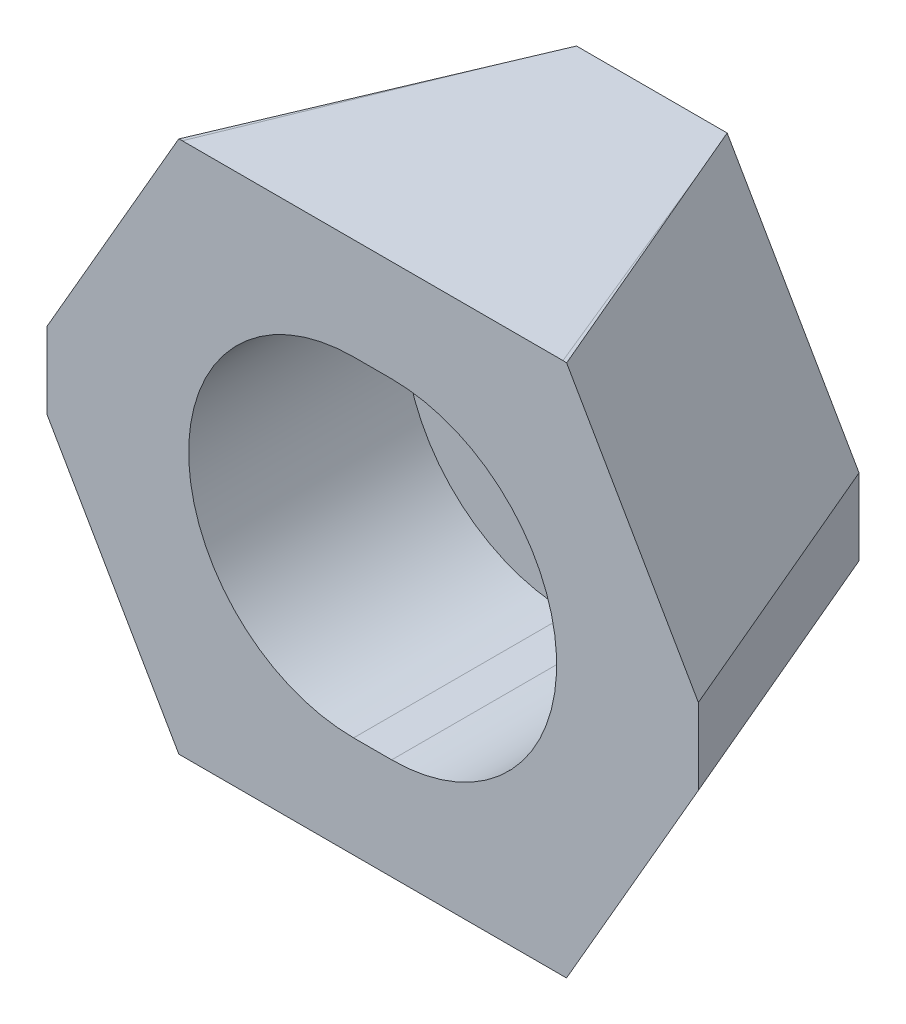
ISO-10303-21;
HEADER;
FILE_DESCRIPTION(('STEP AP214'),'2;1');
FILE_NAME('part.step','',(''),(''),'','','');
FILE_SCHEMA(('AUTOMOTIVE_DESIGN { 1 0 10303 214 1 1 1 1 }'));
ENDSEC;
DATA;
#1=APPLICATION_CONTEXT('core data for automotive mechanical design processes');
#2=APPLICATION_PROTOCOL_DEFINITION('international standard','automotive_design',2000,#1);
#3=PRODUCT_CONTEXT('',#1,'mechanical');
#4=PRODUCT('Part','Part','',(#3));
#5=PRODUCT_RELATED_PRODUCT_CATEGORY('part','',(#4));
#6=PRODUCT_DEFINITION_FORMATION('','',#4);
#7=PRODUCT_DEFINITION_CONTEXT('part definition',#1,'design');
#8=PRODUCT_DEFINITION('design','',#6,#7);
#9=PRODUCT_DEFINITION_SHAPE('','',#8);
#10=(LENGTH_UNIT() NAMED_UNIT(*) SI_UNIT(.MILLI.,.METRE.));
#11=(NAMED_UNIT(*) PLANE_ANGLE_UNIT() SI_UNIT($,.RADIAN.));
#12=(NAMED_UNIT(*) SI_UNIT($,.STERADIAN.) SOLID_ANGLE_UNIT());
#13=UNCERTAINTY_MEASURE_WITH_UNIT(LENGTH_MEASURE(1.E-05),#10,'distance_accuracy_value','');
#14=(GEOMETRIC_REPRESENTATION_CONTEXT(3) GLOBAL_UNCERTAINTY_ASSIGNED_CONTEXT((#13)) GLOBAL_UNIT_ASSIGNED_CONTEXT((#10,
#11,#12)) REPRESENTATION_CONTEXT('',''));
#15=CARTESIAN_POINT('',(0.,0.,0.));
#16=DIRECTION('',(0.,0.,1.));
#17=DIRECTION('',(1.,0.,0.));
#18=AXIS2_PLACEMENT_3D('',#15,#16,#17);
#19=CARTESIAN_POINT('',(-24.2922839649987,3.,22.));
#20=DIRECTION('',(0.,0.,1.));
#21=DIRECTION('',(1.,0.,0.));
#22=AXIS2_PLACEMENT_3D('',#19,#20,#21);
#23=PLANE('',#22);
#24=DIRECTION('',(1.,0.,0.));
#25=VECTOR('',#24,1.);
#26=CARTESIAN_POINT('',(-15.,21.,22.));
#27=LINE('',#26,#25);
#28=CARTESIAN_POINT('',(-15.,21.,22.));
#29=VERTEX_POINT('',#28);
#30=CARTESIAN_POINT('',(15.,21.,22.));
#31=VERTEX_POINT('',#30);
#32=EDGE_CURVE('E174',#29,#31,#27,.T.);
#33=ORIENTED_EDGE('',*,*,#32,.F.);
#34=CARTESIAN_POINT('',(-15.2854132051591,20.983256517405,22.));
#35=CARTESIAN_POINT('',(-15.2735209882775,20.9839541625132,22.));
#36=CARTESIAN_POINT('',(-15.2616287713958,20.9846518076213,22.));
#37=CARTESIAN_POINT('',(-15.2378443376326,20.9860470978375,22.));
#38=CARTESIAN_POINT('',(-15.225952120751,20.9867447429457,22.));
#39=CARTESIAN_POINT('',(-15.2021676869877,20.9881400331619,22.));
#40=CARTESIAN_POINT('',(-15.1902754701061,20.98883767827,22.));
#41=CARTESIAN_POINT('',(-15.1664910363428,20.9902329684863,22.));
#42=CARTESIAN_POINT('',(-15.1545988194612,20.9909306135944,22.));
#43=CARTESIAN_POINT('',(-15.1308143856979,20.9923259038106,22.));
#44=CARTESIAN_POINT('',(-15.1189221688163,20.9930235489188,22.));
#45=CARTESIAN_POINT('',(-15.095137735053,20.994418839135,22.));
#46=CARTESIAN_POINT('',(-15.0832455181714,20.9951164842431,22.));
#47=CARTESIAN_POINT('',(-15.0594610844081,20.9965117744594,22.));
#48=CARTESIAN_POINT('',(-15.0475688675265,20.9972094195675,22.));
#49=CARTESIAN_POINT('',(-15.0237844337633,20.9986047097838,22.));
#50=CARTESIAN_POINT('',(-15.0118922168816,20.9993023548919,22.));
#51=CARTESIAN_POINT('',(-15.,21.,22.));
#52=B_SPLINE_CURVE_WITH_KNOTS('',3,(#34,#35,#36,#37,#38,#39,#40,#41,#42,#43,#44,#45,#46,#47,#48,
#49,#50,#51),.UNSPECIFIED.,.F.,.F.,(4,2,2,2,2,2,2,2,4),(0.,0.0357379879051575,
0.0714759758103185,0.10721396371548,0.142951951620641,0.178689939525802,0.214427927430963,
0.250165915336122,0.285903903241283),.UNSPECIFIED.);
#53=CARTESIAN_POINT('',(-15.2854132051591,20.983256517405,22.));
#54=VERTEX_POINT('',#53);
#55=EDGE_CURVE('E152',#54,#29,#52,.T.);
#56=ORIENTED_EDGE('',*,*,#55,.F.);
#57=DIRECTION('',(-0.5,-0.866025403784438,0.));
#58=VECTOR('',#57,1.);
#59=CARTESIAN_POINT('',(-13.177967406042,24.6334597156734,22.));
#60=LINE('',#59,#58);
#61=CARTESIAN_POINT('',(-25.668051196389,3.,22.));
#62=VERTEX_POINT('',#61);
#63=EDGE_CURVE('E162',#54,#62,#60,.T.);
#64=ORIENTED_EDGE('',*,*,#63,.T.);
#65=DIRECTION('',(0.,1.,0.));
#66=VECTOR('',#65,1.);
#67=CARTESIAN_POINT('',(-25.668051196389,3.,22.));
#68=LINE('',#67,#66);
#69=CARTESIAN_POINT('',(-25.668051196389,-3.00000000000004,22.));
#70=VERTEX_POINT('',#69);
#71=EDGE_CURVE('E207',#70,#62,#68,.T.);
#72=ORIENTED_EDGE('',*,*,#71,.F.);
#73=DIRECTION('',(-0.5,0.866025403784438,0.));
#74=VECTOR('',#73,1.);
#75=CARTESIAN_POINT('',(-15.7760436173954,-20.1334597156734,22.));
#76=LINE('',#75,#74);
#77=CARTESIAN_POINT('',(-15.2757463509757,-21.,22.));
#78=VERTEX_POINT('',#77);
#79=EDGE_CURVE('E209',#78,#70,#76,.T.);
#80=ORIENTED_EDGE('',*,*,#79,.F.);
#81=CARTESIAN_POINT('',(-15.,-21.,22.));
#82=DIRECTION('',(-1.,0.,0.));
#83=VECTOR('',#82,1.);
#84=LINE('',#81,#83);
#85=CARTESIAN_POINT('',(-15.,-21.,22.));
#86=VERTEX_POINT('',#85);
#87=EDGE_CURVE('E176',#86,#78,#84,.T.);
#88=ORIENTED_EDGE('',*,*,#87,.F.);
#89=DIRECTION('',(-1.,0.,0.));
#90=VECTOR('',#89,1.);
#91=CARTESIAN_POINT('',(15.,-21.,22.));
#92=LINE('',#91,#90);
#93=CARTESIAN_POINT('',(15.,-21.,22.));
#94=VERTEX_POINT('',#93);
#95=EDGE_CURVE('E206',#94,#86,#92,.T.);
#96=ORIENTED_EDGE('',*,*,#95,.F.);
#97=CARTESIAN_POINT('',(15.,-21.,22.));
#98=DIRECTION('',(1.,0.,0.));
#99=VECTOR('',#98,1.);
#100=LINE('',#97,#99);
#101=CARTESIAN_POINT('',(15.2757463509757,-21.,22.));
#102=VERTEX_POINT('',#101);
#103=EDGE_CURVE('E284',#94,#102,#100,.T.);
#104=ORIENTED_EDGE('',*,*,#103,.T.);
#105=DIRECTION('',(0.5,0.866025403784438,0.));
#106=VECTOR('',#105,1.);
#107=CARTESIAN_POINT('',(15.7760436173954,-20.1334597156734,22.));
#108=LINE('',#107,#106);
#109=CARTESIAN_POINT('',(25.668051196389,-3.,22.));
#110=VERTEX_POINT('',#109);
#111=EDGE_CURVE('E33',#102,#110,#108,.T.);
#112=ORIENTED_EDGE('',*,*,#111,.T.);
#113=DIRECTION('',(0.,1.,0.));
#114=VECTOR('',#113,1.);
#115=CARTESIAN_POINT('',(25.668051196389,3.,22.));
#116=LINE('',#115,#114);
#117=CARTESIAN_POINT('',(25.668051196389,3.,22.));
#118=VERTEX_POINT('',#117);
#119=EDGE_CURVE('E37',#110,#118,#116,.T.);
#120=ORIENTED_EDGE('',*,*,#119,.T.);
#121=DIRECTION('',(0.5,-0.866025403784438,0.));
#122=VECTOR('',#121,1.);
#123=CARTESIAN_POINT('',(13.177967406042,24.6334597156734,22.));
#124=LINE('',#123,#122);
#125=CARTESIAN_POINT('',(15.2854132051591,20.983256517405,22.));
#126=VERTEX_POINT('',#125);
#127=EDGE_CURVE('E265',#126,#118,#124,.T.);
#128=ORIENTED_EDGE('',*,*,#127,.F.);
#129=CARTESIAN_POINT('',(15.,21.,22.));
#130=CARTESIAN_POINT('',(15.0118922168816,20.9993023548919,22.));
#131=CARTESIAN_POINT('',(15.0237844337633,20.9986047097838,22.));
#132=CARTESIAN_POINT('',(15.0475688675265,20.9972094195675,22.));
#133=CARTESIAN_POINT('',(15.0594610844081,20.9965117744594,22.));
#134=CARTESIAN_POINT('',(15.0832455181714,20.9951164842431,22.));
#135=CARTESIAN_POINT('',(15.095137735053,20.994418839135,22.));
#136=CARTESIAN_POINT('',(15.1189221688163,20.9930235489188,22.));
#137=CARTESIAN_POINT('',(15.1308143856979,20.9923259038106,22.));
#138=CARTESIAN_POINT('',(15.1545988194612,20.9909306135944,22.));
#139=CARTESIAN_POINT('',(15.1664910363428,20.9902329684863,22.));
#140=CARTESIAN_POINT('',(15.1902754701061,20.98883767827,22.));
#141=CARTESIAN_POINT('',(15.2021676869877,20.9881400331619,22.));
#142=CARTESIAN_POINT('',(15.225952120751,20.9867447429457,22.));
#143=CARTESIAN_POINT('',(15.2378443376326,20.9860470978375,22.));
#144=CARTESIAN_POINT('',(15.2616287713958,20.9846518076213,22.));
#145=CARTESIAN_POINT('',(15.2735209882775,20.9839541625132,22.));
#146=CARTESIAN_POINT('',(15.2854132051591,20.983256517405,22.));
#147=B_SPLINE_CURVE_WITH_KNOTS('',3,(#129,#130,#131,#132,#133,#134,#135,#136,#137,#138,#139,
#140,#141,#142,#143,#144,#145,#146),.UNSPECIFIED.,.F.,.F.,(4,2,2,2,2,2,2,2,4),(0.,
0.0357379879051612,0.0714759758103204,0.107213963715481,0.142951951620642,0.178689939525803,
0.214427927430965,0.250165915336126,0.285903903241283),.UNSPECIFIED.);
#148=EDGE_CURVE('E344',#126,#31,#147,.F.);
#149=ORIENTED_EDGE('',*,*,#148,.T.);
#150=EDGE_LOOP('',(#33,#56,#64,#72,#80,#88,#96,#104,#112,#120,#128,#149));
#151=FACE_BOUND('',#150,.T.);
#152=DIRECTION('',(1.,0.,0.));
#153=VECTOR('',#152,1.);
#154=CARTESIAN_POINT('',(-1.5,-13.,22.));
#155=LINE('',#154,#153);
#156=CARTESIAN_POINT('',(-1.5,-13.,22.));
#157=VERTEX_POINT('',#156);
#158=CARTESIAN_POINT('',(1.5,-13.,22.));
#159=VERTEX_POINT('',#158);
#160=EDGE_CURVE('E373',#157,#159,#155,.T.);
#161=ORIENTED_EDGE('',*,*,#160,.F.);
#162=CARTESIAN_POINT('',(-1.5,0.,22.));
#163=DIRECTION('',(0.,0.,-1.));
#164=DIRECTION('',(-1.,0.,0.));
#165=AXIS2_PLACEMENT_3D('',#162,#163,#164);
#166=CIRCLE('',#165,13.);
#167=CARTESIAN_POINT('',(-1.50000000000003,13.,22.));
#168=VERTEX_POINT('',#167);
#169=EDGE_CURVE('E428',#157,#168,#166,.T.);
#170=ORIENTED_EDGE('',*,*,#169,.T.);
#171=DIRECTION('',(1.,0.,0.));
#172=VECTOR('',#171,1.);
#173=CARTESIAN_POINT('',(-1.5,13.,22.));
#174=LINE('',#173,#172);
#175=CARTESIAN_POINT('',(1.50000000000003,13.,22.));
#176=VERTEX_POINT('',#175);
#177=EDGE_CURVE('E377',#168,#176,#174,.T.);
#178=ORIENTED_EDGE('',*,*,#177,.T.);
#179=CARTESIAN_POINT('',(1.5,0.,22.));
#180=DIRECTION('',(0.,0.,1.));
#181=DIRECTION('',(1.,0.,0.));
#182=AXIS2_PLACEMENT_3D('',#179,#180,#181);
#183=CIRCLE('',#182,13.);
#184=EDGE_CURVE('E379',#159,#176,#183,.T.);
#185=ORIENTED_EDGE('',*,*,#184,.F.);
#186=EDGE_LOOP('',(#161,#170,#178,#185));
#187=FACE_BOUND('',#186,.T.);
#188=ADVANCED_FACE('F14',(#151,#187),#23,.T.);
#189=CARTESIAN_POINT('',(15.0443355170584,3.,0.));
#190=DIRECTION('',(0.,0.,-1.));
#191=DIRECTION('',(0.,1.,0.));
#192=AXIS2_PLACEMENT_3D('',#189,#190,#191);
#193=PLANE('',#192);
#194=DIRECTION('',(1.,0.,0.));
#195=VECTOR('',#194,1.);
#196=CARTESIAN_POINT('',(-1.5,8.5,0.));
#197=LINE('',#196,#195);
#198=CARTESIAN_POINT('',(-1.50000000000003,8.5,0.));
#199=VERTEX_POINT('',#198);
#200=CARTESIAN_POINT('',(1.50000000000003,8.5,0.));
#201=VERTEX_POINT('',#200);
#202=EDGE_CURVE('E289',#199,#201,#197,.T.);
#203=ORIENTED_EDGE('',*,*,#202,.F.);
#204=CARTESIAN_POINT('',(-1.5,0.,0.));
#205=DIRECTION('',(0.,0.,1.));
#206=DIRECTION('',(0.,1.,0.));
#207=AXIS2_PLACEMENT_3D('',#204,#205,#206);
#208=CIRCLE('',#207,8.5);
#209=CARTESIAN_POINT('',(-1.49999999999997,-8.5,0.));
#210=VERTEX_POINT('',#209);
#211=EDGE_CURVE('E175',#199,#210,#208,.T.);
#212=ORIENTED_EDGE('',*,*,#211,.T.);
#213=DIRECTION('',(1.,0.,0.));
#214=VECTOR('',#213,1.);
#215=CARTESIAN_POINT('',(-1.5,-8.5,0.));
#216=LINE('',#215,#214);
#217=CARTESIAN_POINT('',(1.49999999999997,-8.5,0.));
#218=VERTEX_POINT('',#217);
#219=EDGE_CURVE('E396',#210,#218,#216,.T.);
#220=ORIENTED_EDGE('',*,*,#219,.T.);
#221=CARTESIAN_POINT('',(1.5,0.,0.));
#222=DIRECTION('',(0.,0.,-1.));
#223=DIRECTION('',(0.,1.,0.));
#224=AXIS2_PLACEMENT_3D('',#221,#222,#223);
#225=CIRCLE('',#224,8.5);
#226=EDGE_CURVE('E397',#201,#218,#225,.T.);
#227=ORIENTED_EDGE('',*,*,#226,.F.);
#228=EDGE_LOOP('',(#203,#212,#220,#227));
#229=FACE_BOUND('',#228,.T.);
#230=DIRECTION('',(0.5,0.866025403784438,0.));
#231=VECTOR('',#230,1.);
#232=CARTESIAN_POINT('',(-16.0082878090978,3.55653811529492,0.));
#233=LINE('',#232,#231);
#234=CARTESIAN_POINT('',(-16.3296052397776,3.,0.));
#235=VERTEX_POINT('',#234);
#236=CARTESIAN_POINT('',(-5.93730039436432,21.,0.));
#237=VERTEX_POINT('',#236);
#238=EDGE_CURVE('E214',#235,#237,#233,.T.);
#239=ORIENTED_EDGE('',*,*,#238,.T.);
#240=DIRECTION('',(1.,0.,0.));
#241=VECTOR('',#240,1.);
#242=CARTESIAN_POINT('',(-6.,21.,0.));
#243=LINE('',#242,#241);
#244=CARTESIAN_POINT('',(5.93730039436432,21.,0.));
#245=VERTEX_POINT('',#244);
#246=EDGE_CURVE('E331',#237,#245,#243,.T.);
#247=ORIENTED_EDGE('',*,*,#246,.T.);
#248=DIRECTION('',(-0.5,0.866025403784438,0.));
#249=VECTOR('',#248,1.);
#250=CARTESIAN_POINT('',(16.0082878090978,3.55653811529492,0.));
#251=LINE('',#250,#249);
#252=CARTESIAN_POINT('',(16.3296052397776,3.,0.));
#253=VERTEX_POINT('',#252);
#254=EDGE_CURVE('E274',#253,#245,#251,.T.);
#255=ORIENTED_EDGE('',*,*,#254,.F.);
#256=DIRECTION('',(0.,-1.,0.));
#257=VECTOR('',#256,1.);
#258=CARTESIAN_POINT('',(16.3296052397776,3.,0.));
#259=LINE('',#258,#257);
#260=CARTESIAN_POINT('',(16.3296052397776,-3.,0.));
#261=VERTEX_POINT('',#260);
#262=EDGE_CURVE('E9',#253,#261,#259,.T.);
#263=ORIENTED_EDGE('',*,*,#262,.T.);
#264=DIRECTION('',(-0.5,-0.866025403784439,0.));
#265=VECTOR('',#264,1.);
#266=CARTESIAN_POINT('',(18.6063640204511,0.94346188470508,0.));
#267=LINE('',#266,#265);
#268=CARTESIAN_POINT('',(5.93730039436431,-21.,0.));
#269=VERTEX_POINT('',#268);
#270=EDGE_CURVE('E277',#261,#269,#267,.T.);
#271=ORIENTED_EDGE('',*,*,#270,.T.);
#272=DIRECTION('',(1.,0.,0.));
#273=VECTOR('',#272,1.);
#274=CARTESIAN_POINT('',(-6.,-21.,0.));
#275=LINE('',#274,#273);
#276=CARTESIAN_POINT('',(-5.93730039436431,-21.,0.));
#277=VERTEX_POINT('',#276);
#278=EDGE_CURVE('E179',#277,#269,#275,.T.);
#279=ORIENTED_EDGE('',*,*,#278,.F.);
#280=DIRECTION('',(0.5,-0.866025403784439,0.));
#281=VECTOR('',#280,1.);
#282=CARTESIAN_POINT('',(-18.6063640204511,0.943461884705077,0.));
#283=LINE('',#282,#281);
#284=CARTESIAN_POINT('',(-16.3296052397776,-3.00000000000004,0.));
#285=VERTEX_POINT('',#284);
#286=EDGE_CURVE('E211',#285,#277,#283,.T.);
#287=ORIENTED_EDGE('',*,*,#286,.F.);
#288=DIRECTION('',(0.,-1.,0.));
#289=VECTOR('',#288,1.);
#290=CARTESIAN_POINT('',(-16.3296052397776,3.,0.));
#291=LINE('',#290,#289);
#292=EDGE_CURVE('E256',#235,#285,#291,.T.);
#293=ORIENTED_EDGE('',*,*,#292,.F.);
#294=EDGE_LOOP('',(#239,#247,#255,#263,#271,#279,#287,#293));
#295=FACE_BOUND('',#294,.T.);
#296=ADVANCED_FACE('F412',(#229,#295),#193,.T.);
#297=CARTESIAN_POINT('',(15.,-21.,22.));
#298=DIRECTION('',(0.,1.,0.));
#299=DIRECTION('',(0.,0.,1.));
#300=AXIS2_PLACEMENT_3D('',#297,#298,#299);
#301=PLANE('',#300);
#302=ORIENTED_EDGE('',*,*,#95,.T.);
#303=ORIENTED_EDGE('',*,*,#87,.T.);
#304=DIRECTION('',(0.390731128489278,0.,-0.920504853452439));
#305=VECTOR('',#304,1.);
#306=CARTESIAN_POINT('',(-15.2336479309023,-21.,21.9008223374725));
#307=LINE('',#306,#305);
#308=EDGE_CURVE('E159',#78,#277,#307,.T.);
#309=ORIENTED_EDGE('',*,*,#308,.T.);
#310=ORIENTED_EDGE('',*,*,#278,.T.);
#311=DIRECTION('',(-0.390731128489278,0.,-0.920504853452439));
#312=VECTOR('',#311,1.);
#313=CARTESIAN_POINT('',(15.2336479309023,-21.,21.9008223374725));
#314=LINE('',#313,#312);
#315=EDGE_CURVE('E25',#102,#269,#314,.T.);
#316=ORIENTED_EDGE('',*,*,#315,.F.);
#317=ORIENTED_EDGE('',*,*,#103,.F.);
#318=EDGE_LOOP('',(#302,#303,#309,#310,#316,#317));
#319=FACE_BOUND('',#318,.T.);
#320=ADVANCED_FACE('F204',(#319),#301,.F.);
#321=CARTESIAN_POINT('',(-1.5,13.,5.));
#322=DIRECTION('',(0.,-1.,0.));
#323=DIRECTION('',(0.,0.,-1.));
#324=AXIS2_PLACEMENT_3D('',#321,#322,#323);
#325=PLANE('',#324);
#326=ORIENTED_EDGE('',*,*,#177,.F.);
#327=DIRECTION('',(0.,0.,1.));
#328=VECTOR('',#327,1.);
#329=CARTESIAN_POINT('',(-1.50000000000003,13.,5.));
#330=LINE('',#329,#328);
#331=CARTESIAN_POINT('',(-1.50000000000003,13.,5.));
#332=VERTEX_POINT('',#331);
#333=EDGE_CURVE('E437',#332,#168,#330,.T.);
#334=ORIENTED_EDGE('',*,*,#333,.F.);
#335=DIRECTION('',(1.,0.,0.));
#336=VECTOR('',#335,1.);
#337=CARTESIAN_POINT('',(-1.5,13.,5.));
#338=LINE('',#337,#336);
#339=CARTESIAN_POINT('',(1.50000000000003,13.,5.));
#340=VERTEX_POINT('',#339);
#341=EDGE_CURVE('E370',#332,#340,#338,.T.);
#342=ORIENTED_EDGE('',*,*,#341,.T.);
#343=DIRECTION('',(0.,0.,1.));
#344=VECTOR('',#343,1.);
#345=CARTESIAN_POINT('',(1.50000000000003,13.,5.));
#346=LINE('',#345,#344);
#347=EDGE_CURVE('E360',#340,#176,#346,.T.);
#348=ORIENTED_EDGE('',*,*,#347,.T.);
#349=EDGE_LOOP('',(#326,#334,#342,#348));
#350=FACE_BOUND('',#349,.T.);
#351=ADVANCED_FACE('F482',(#350),#325,.T.);
#352=CARTESIAN_POINT('',(1.5,0.,5.));
#353=DIRECTION('',(0.,0.,1.));
#354=DIRECTION('',(1.,0.,0.));
#355=AXIS2_PLACEMENT_3D('',#352,#353,#354);
#356=CYLINDRICAL_SURFACE('',#355,13.);
#357=DIRECTION('',(0.,0.,1.));
#358=VECTOR('',#357,1.);
#359=CARTESIAN_POINT('',(1.5,-13.,5.));
#360=LINE('',#359,#358);
#361=CARTESIAN_POINT('',(1.5,-13.,5.));
#362=VERTEX_POINT('',#361);
#363=EDGE_CURVE('E363',#362,#159,#360,.T.);
#364=ORIENTED_EDGE('',*,*,#363,.T.);
#365=ORIENTED_EDGE('',*,*,#184,.T.);
#366=ORIENTED_EDGE('',*,*,#347,.F.);
#367=CARTESIAN_POINT('',(1.5,0.,5.));
#368=DIRECTION('',(0.,0.,1.));
#369=DIRECTION('',(1.,0.,0.));
#370=AXIS2_PLACEMENT_3D('',#367,#368,#369);
#371=CIRCLE('',#370,13.);
#372=EDGE_CURVE('E372',#362,#340,#371,.T.);
#373=ORIENTED_EDGE('',*,*,#372,.F.);
#374=EDGE_LOOP('',(#364,#365,#366,#373));
#375=FACE_BOUND('',#374,.T.);
#376=ADVANCED_FACE('F491',(#375),#356,.F.);
#377=CARTESIAN_POINT('',(-1.5,-13.,5.));
#378=DIRECTION('',(0.,-1.,0.));
#379=DIRECTION('',(0.,0.,-1.));
#380=AXIS2_PLACEMENT_3D('',#377,#378,#379);
#381=PLANE('',#380);
#382=DIRECTION('',(1.,0.,0.));
#383=VECTOR('',#382,1.);
#384=CARTESIAN_POINT('',(-1.5,-13.,5.));
#385=LINE('',#384,#383);
#386=CARTESIAN_POINT('',(-1.5,-13.,5.));
#387=VERTEX_POINT('',#386);
#388=EDGE_CURVE('E369',#387,#362,#385,.T.);
#389=ORIENTED_EDGE('',*,*,#388,.F.);
#390=DIRECTION('',(0.,0.,1.));
#391=VECTOR('',#390,1.);
#392=CARTESIAN_POINT('',(-1.5,-13.,5.));
#393=LINE('',#392,#391);
#394=EDGE_CURVE('E434',#387,#157,#393,.T.);
#395=ORIENTED_EDGE('',*,*,#394,.T.);
#396=ORIENTED_EDGE('',*,*,#160,.T.);
#397=ORIENTED_EDGE('',*,*,#363,.F.);
#398=EDGE_LOOP('',(#389,#395,#396,#397));
#399=FACE_BOUND('',#398,.T.);
#400=ADVANCED_FACE('F485',(#399),#381,.F.);
#401=CARTESIAN_POINT('',(-1.5,0.,5.));
#402=DIRECTION('',(0.,0.,1.));
#403=DIRECTION('',(1.,0.,0.));
#404=AXIS2_PLACEMENT_3D('',#401,#402,#403);
#405=PLANE('',#404);
#406=ORIENTED_EDGE('',*,*,#341,.F.);
#407=CARTESIAN_POINT('',(-1.5,0.,5.));
#408=DIRECTION('',(0.,0.,-1.));
#409=DIRECTION('',(-1.,0.,0.));
#410=AXIS2_PLACEMENT_3D('',#407,#408,#409);
#411=CIRCLE('',#410,13.);
#412=EDGE_CURVE('E431',#387,#332,#411,.T.);
#413=ORIENTED_EDGE('',*,*,#412,.F.);
#414=ORIENTED_EDGE('',*,*,#388,.T.);
#415=ORIENTED_EDGE('',*,*,#372,.T.);
#416=EDGE_LOOP('',(#406,#413,#414,#415));
#417=FACE_BOUND('',#416,.T.);
#418=DIRECTION('',(-1.,0.,0.));
#419=VECTOR('',#418,1.);
#420=CARTESIAN_POINT('',(-1.5,-8.5,5.));
#421=LINE('',#420,#419);
#422=CARTESIAN_POINT('',(1.49999999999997,-8.5,5.));
#423=VERTEX_POINT('',#422);
#424=CARTESIAN_POINT('',(-1.49999999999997,-8.5,5.));
#425=VERTEX_POINT('',#424);
#426=EDGE_CURVE('E380',#423,#425,#421,.T.);
#427=ORIENTED_EDGE('',*,*,#426,.T.);
#428=CARTESIAN_POINT('',(-1.5,0.,5.));
#429=DIRECTION('',(0.,0.,-1.));
#430=DIRECTION('',(-1.,0.,0.));
#431=AXIS2_PLACEMENT_3D('',#428,#429,#430);
#432=CIRCLE('',#431,8.5);
#433=CARTESIAN_POINT('',(-1.50000000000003,8.5,5.));
#434=VERTEX_POINT('',#433);
#435=EDGE_CURVE('E422',#425,#434,#432,.T.);
#436=ORIENTED_EDGE('',*,*,#435,.T.);
#437=DIRECTION('',(-1.,0.,0.));
#438=VECTOR('',#437,1.);
#439=CARTESIAN_POINT('',(-1.5,8.5,5.));
#440=LINE('',#439,#438);
#441=CARTESIAN_POINT('',(1.50000000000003,8.5,5.));
#442=VERTEX_POINT('',#441);
#443=EDGE_CURVE('E388',#442,#434,#440,.T.);
#444=ORIENTED_EDGE('',*,*,#443,.F.);
#445=CARTESIAN_POINT('',(1.5,0.,5.));
#446=DIRECTION('',(0.,0.,1.));
#447=DIRECTION('',(1.,0.,0.));
#448=AXIS2_PLACEMENT_3D('',#445,#446,#447);
#449=CIRCLE('',#448,8.5);
#450=EDGE_CURVE('E385',#423,#442,#449,.T.);
#451=ORIENTED_EDGE('',*,*,#450,.F.);
#452=EDGE_LOOP('',(#427,#436,#444,#451));
#453=FACE_BOUND('',#452,.T.);
#454=ADVANCED_FACE('F419',(#417,#453),#405,.T.);
#455=CARTESIAN_POINT('',(-6.,21.,0.));
#456=DIRECTION('',(0.,1.,0.));
#457=DIRECTION('',(0.,0.,1.));
#458=AXIS2_PLACEMENT_3D('',#455,#456,#457);
#459=PLANE('',#458);
#460=ORIENTED_EDGE('',*,*,#246,.F.);
#461=DIRECTION('',(-0.390731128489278,0.,0.920504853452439));
#462=VECTOR('',#461,1.);
#463=CARTESIAN_POINT('',(-4.11482301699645,21.,-4.2934876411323));
#464=LINE('',#463,#462);
#465=CARTESIAN_POINT('',(-7.66731627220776,21.,4.07566199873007));
#466=VERTEX_POINT('',#465);
#467=EDGE_CURVE('E168',#237,#466,#464,.T.);
#468=ORIENTED_EDGE('',*,*,#467,.T.);
#469=DIRECTION('',(-0.378632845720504,0.,0.925546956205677));
#470=VECTOR('',#469,1.);
#471=CARTESIAN_POINT('',(-6.,21.,0.));
#472=LINE('',#471,#470);
#473=EDGE_CURVE('E155',#466,#29,#472,.T.);
#474=ORIENTED_EDGE('',*,*,#473,.T.);
#475=ORIENTED_EDGE('',*,*,#32,.T.);
#476=DIRECTION('',(0.378632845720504,0.,0.925546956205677));
#477=VECTOR('',#476,1.);
#478=CARTESIAN_POINT('',(6.,21.,0.));
#479=LINE('',#478,#477);
#480=CARTESIAN_POINT('',(7.66731627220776,21.,4.07566199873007));
#481=VERTEX_POINT('',#480);
#482=EDGE_CURVE('E333',#481,#31,#479,.T.);
#483=ORIENTED_EDGE('',*,*,#482,.F.);
#484=DIRECTION('',(0.390731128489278,0.,0.920504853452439));
#485=VECTOR('',#484,1.);
#486=CARTESIAN_POINT('',(4.11482301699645,21.,-4.2934876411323));
#487=LINE('',#486,#485);
#488=EDGE_CURVE('E269',#245,#481,#487,.T.);
#489=ORIENTED_EDGE('',*,*,#488,.F.);
#490=EDGE_LOOP('',(#460,#468,#474,#475,#483,#489));
#491=FACE_BOUND('',#490,.T.);
#492=ADVANCED_FACE('F442',(#491),#459,.T.);
#493=CARTESIAN_POINT('',(-1.5,-8.5,22.));
#494=DIRECTION('',(0.,1.,0.));
#495=DIRECTION('',(0.,0.,1.));
#496=AXIS2_PLACEMENT_3D('',#493,#494,#495);
#497=PLANE('',#496);
#498=ORIENTED_EDGE('',*,*,#219,.F.);
#499=DIRECTION('',(0.,0.,-1.));
#500=VECTOR('',#499,1.);
#501=CARTESIAN_POINT('',(-1.49999999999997,-8.5,22.));
#502=LINE('',#501,#500);
#503=EDGE_CURVE('E424',#425,#210,#502,.T.);
#504=ORIENTED_EDGE('',*,*,#503,.F.);
#505=ORIENTED_EDGE('',*,*,#426,.F.);
#506=DIRECTION('',(0.,0.,-1.));
#507=VECTOR('',#506,1.);
#508=CARTESIAN_POINT('',(1.49999999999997,-8.5,22.));
#509=LINE('',#508,#507);
#510=EDGE_CURVE('E390',#423,#218,#509,.T.);
#511=ORIENTED_EDGE('',*,*,#510,.T.);
#512=EDGE_LOOP('',(#498,#504,#505,#511));
#513=FACE_BOUND('',#512,.T.);
#514=ADVANCED_FACE('F417',(#513),#497,.T.);
#515=CARTESIAN_POINT('',(1.5,0.,22.));
#516=DIRECTION('',(0.,0.,-1.));
#517=DIRECTION('',(0.,1.,0.));
#518=AXIS2_PLACEMENT_3D('',#515,#516,#517);
#519=CYLINDRICAL_SURFACE('',#518,8.5);
#520=ORIENTED_EDGE('',*,*,#450,.T.);
#521=DIRECTION('',(0.,0.,-1.));
#522=VECTOR('',#521,1.);
#523=CARTESIAN_POINT('',(1.50000000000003,8.5,22.));
#524=LINE('',#523,#522);
#525=EDGE_CURVE('E393',#442,#201,#524,.T.);
#526=ORIENTED_EDGE('',*,*,#525,.T.);
#527=ORIENTED_EDGE('',*,*,#226,.T.);
#528=ORIENTED_EDGE('',*,*,#510,.F.);
#529=EDGE_LOOP('',(#520,#526,#527,#528));
#530=FACE_BOUND('',#529,.T.);
#531=ADVANCED_FACE('F409',(#530),#519,.F.);
#532=CARTESIAN_POINT('',(-1.5,8.5,22.));
#533=DIRECTION('',(0.,1.,0.));
#534=DIRECTION('',(0.,0.,1.));
#535=AXIS2_PLACEMENT_3D('',#532,#533,#534);
#536=PLANE('',#535);
#537=ORIENTED_EDGE('',*,*,#443,.T.);
#538=DIRECTION('',(0.,0.,-1.));
#539=VECTOR('',#538,1.);
#540=CARTESIAN_POINT('',(-1.50000000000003,8.5,22.));
#541=LINE('',#540,#539);
#542=EDGE_CURVE('E405',#434,#199,#541,.T.);
#543=ORIENTED_EDGE('',*,*,#542,.T.);
#544=ORIENTED_EDGE('',*,*,#202,.T.);
#545=ORIENTED_EDGE('',*,*,#525,.F.);
#546=EDGE_LOOP('',(#537,#543,#544,#545));
#547=FACE_BOUND('',#546,.T.);
#548=ADVANCED_FACE('F305',(#547),#536,.F.);
#549=CARTESIAN_POINT('',(15.,21.,22.));
#550=CARTESIAN_POINT('',(6.,21.,0.));
#551=CARTESIAN_POINT('',(19.951595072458,20.7095195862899,22.));
#552=CARTESIAN_POINT('',(11.6148223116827,20.5523403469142,0.));
#553=CARTESIAN_POINT('',(24.9031901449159,20.4190391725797,22.));
#554=CARTESIAN_POINT('',(17.2296446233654,20.1046806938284,0.));
#555=CARTESIAN_POINT('',(34.8063802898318,19.8380783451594,22.));
#556=CARTESIAN_POINT('',(28.4592892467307,19.2093613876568,0.));
#557=CARTESIAN_POINT('',(39.7579753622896,19.5475979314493,22.));
#558=CARTESIAN_POINT('',(34.0741115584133,18.761701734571,0.));
#559=CARTESIAN_POINT('',(44.7095704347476,19.2571175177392,22.));
#560=CARTESIAN_POINT('',(39.6889338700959,18.3140420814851,0.));
#561=B_SPLINE_SURFACE_WITH_KNOTS('',3,1,((#549,#550),(#551,#552),(#553,#554),(#555,#556),(#557,
#558),(#559,#560)),.UNSPECIFIED.,.F.,.F.,.F.,(4,2,4),(2,2),(0.,0.5,1.),(0.,1.),.UNSPECIFIED.);
#562=CARTESIAN_POINT('',(7.66731627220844,21.,4.07566199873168));
#563=CARTESIAN_POINT('',(8.30237084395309,20.9981685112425,5.56926571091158));
#564=CARTESIAN_POINT('',(8.93737705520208,20.9964359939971,7.06289010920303));
#565=CARTESIAN_POINT('',(10.2072854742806,20.9931837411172,10.0501833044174));
#566=CARTESIAN_POINT('',(10.8421876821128,20.9916640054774,11.5438521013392));
#567=CARTESIAN_POINT('',(12.1118809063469,20.9888521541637,14.5312373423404));
#568=CARTESIAN_POINT('',(12.7466719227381,20.9875600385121,16.0249537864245));
#569=CARTESIAN_POINT('',(14.016134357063,20.98522049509,19.0124377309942));
#570=CARTESIAN_POINT('',(14.6508057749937,20.9841730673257,20.5062052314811));
#571=CARTESIAN_POINT('',(15.2854132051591,20.983256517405,22.));
#572=B_SPLINE_CURVE_WITH_KNOTS('',3,(#562,#563,#564,#565,#566,#567,#568,#569,#570,#571),
.UNSPECIFIED.,.F.,.F.,(4,2,2,2,4),(0.,4.86901914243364,9.73803816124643,14.6070576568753,
19.476077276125),.UNSPECIFIED.);
#573=EDGE_CURVE('E325',#481,#126,#572,.T.);
#574=ORIENTED_EDGE('',*,*,#573,.F.);
#575=ORIENTED_EDGE('',*,*,#482,.T.);
#576=ORIENTED_EDGE('',*,*,#148,.F.);
#577=EDGE_LOOP('',(#574,#575,#576));
#578=FACE_BOUND('',#577,.T.);
#579=ADVANCED_FACE('F292',(#578),#561,.T.);
#580=CARTESIAN_POINT('',(-17.1572568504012,-21.,-54.4073673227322));
#581=DIRECTION('',(0.812843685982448,-0.469295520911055,-0.345031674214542));
#582=DIRECTION('',(0.5,0.866025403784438,0.));
#583=AXIS2_PLACEMENT_3D('',#580,#581,#582);
#584=PLANE('',#583);
#585=ORIENTED_EDGE('',*,*,#111,.F.);
#586=ORIENTED_EDGE('',*,*,#315,.T.);
#587=ORIENTED_EDGE('',*,*,#270,.F.);
#588=DIRECTION('',(0.390731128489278,0.,0.920504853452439));
#589=VECTOR('',#588,1.);
#590=CARTESIAN_POINT('',(-6.76495200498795,-3.,-54.4073673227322));
#591=LINE('',#590,#589);
#592=EDGE_CURVE('E262',#261,#110,#591,.T.);
#593=ORIENTED_EDGE('',*,*,#592,.T.);
#594=EDGE_LOOP('',(#585,#586,#587,#593));
#595=FACE_BOUND('',#594,.T.);
#596=ADVANCED_FACE('F304',(#595),#584,.T.);
#597=CARTESIAN_POINT('',(-6.76495200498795,-3.,-54.4073673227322));
#598=DIRECTION('',(0.920504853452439,0.,-0.390731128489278));
#599=DIRECTION('',(-0.390731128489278,0.,-0.920504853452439));
#600=AXIS2_PLACEMENT_3D('',#597,#598,#599);
#601=PLANE('',#600);
#602=ORIENTED_EDGE('',*,*,#119,.F.);
#603=ORIENTED_EDGE('',*,*,#592,.F.);
#604=ORIENTED_EDGE('',*,*,#262,.F.);
#605=DIRECTION('',(0.390731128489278,0.,0.920504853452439));
#606=VECTOR('',#605,1.);
#607=CARTESIAN_POINT('',(-6.76495200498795,3.,-54.4073673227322));
#608=LINE('',#607,#606);
#609=EDGE_CURVE('E261',#253,#118,#608,.T.);
#610=ORIENTED_EDGE('',*,*,#609,.T.);
#611=EDGE_LOOP('',(#602,#603,#604,#610));
#612=FACE_BOUND('',#611,.T.);
#613=ADVANCED_FACE('F460',(#612),#601,.T.);
#614=CARTESIAN_POINT('',(-17.1572568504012,21.,-54.4073673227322));
#615=DIRECTION('',(-0.812843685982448,-0.469295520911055,0.345031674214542));
#616=DIRECTION('',(0.5,-0.866025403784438,0.));
#617=AXIS2_PLACEMENT_3D('',#614,#615,#616);
#618=PLANE('',#617);
#619=ORIENTED_EDGE('',*,*,#609,.F.);
#620=ORIENTED_EDGE('',*,*,#254,.T.);
#621=ORIENTED_EDGE('',*,*,#488,.T.);
#622=ORIENTED_EDGE('',*,*,#573,.T.);
#623=ORIENTED_EDGE('',*,*,#127,.T.);
#624=EDGE_LOOP('',(#619,#620,#621,#622,#623));
#625=FACE_BOUND('',#624,.T.);
#626=ADVANCED_FACE('F307',(#625),#618,.F.);
#627=CARTESIAN_POINT('',(-1.5,0.,5.));
#628=DIRECTION('',(0.,0.,1.));
#629=DIRECTION('',(-1.,0.,0.));
#630=AXIS2_PLACEMENT_3D('',#627,#628,#629);
#631=CYLINDRICAL_SURFACE('',#630,13.);
#632=ORIENTED_EDGE('',*,*,#394,.F.);
#633=ORIENTED_EDGE('',*,*,#412,.T.);
#634=ORIENTED_EDGE('',*,*,#333,.T.);
#635=ORIENTED_EDGE('',*,*,#169,.F.);
#636=EDGE_LOOP('',(#632,#633,#634,#635));
#637=FACE_BOUND('',#636,.T.);
#638=ADVANCED_FACE('F465',(#637),#631,.F.);
#639=CARTESIAN_POINT('',(-1.5,0.,22.));
#640=DIRECTION('',(0.,0.,-1.));
#641=DIRECTION('',(0.,1.,0.));
#642=AXIS2_PLACEMENT_3D('',#639,#640,#641);
#643=CYLINDRICAL_SURFACE('',#642,8.5);
#644=ORIENTED_EDGE('',*,*,#435,.F.);
#645=ORIENTED_EDGE('',*,*,#503,.T.);
#646=ORIENTED_EDGE('',*,*,#211,.F.);
#647=ORIENTED_EDGE('',*,*,#542,.F.);
#648=EDGE_LOOP('',(#644,#645,#646,#647));
#649=FACE_BOUND('',#648,.T.);
#650=ADVANCED_FACE('F237',(#649),#643,.F.);
#651=CARTESIAN_POINT('',(-15.,21.,22.));
#652=CARTESIAN_POINT('',(-6.,21.,0.));
#653=CARTESIAN_POINT('',(-19.951595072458,20.7095195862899,22.));
#654=CARTESIAN_POINT('',(-11.6148223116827,20.5523403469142,0.));
#655=CARTESIAN_POINT('',(-24.9031901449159,20.4190391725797,22.));
#656=CARTESIAN_POINT('',(-17.2296446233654,20.1046806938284,0.));
#657=CARTESIAN_POINT('',(-34.8063802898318,19.8380783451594,22.));
#658=CARTESIAN_POINT('',(-28.4592892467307,19.2093613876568,0.));
#659=CARTESIAN_POINT('',(-39.7579753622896,19.5475979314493,22.));
#660=CARTESIAN_POINT('',(-34.0741115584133,18.761701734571,0.));
#661=CARTESIAN_POINT('',(-44.7095704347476,19.2571175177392,22.));
#662=CARTESIAN_POINT('',(-39.6889338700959,18.3140420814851,0.));
#663=B_SPLINE_SURFACE_WITH_KNOTS('',3,1,((#651,#652),(#653,#654),(#655,#656),(#657,#658),(#659,
#660),(#661,#662)),.UNSPECIFIED.,.F.,.F.,.F.,(4,2,4),(2,2),(0.,0.5,1.),(0.,1.),.UNSPECIFIED.);
#664=CARTESIAN_POINT('',(-7.66731627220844,21.,4.07566199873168));
#665=CARTESIAN_POINT('',(-8.30237084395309,20.9981685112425,5.56926571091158));
#666=CARTESIAN_POINT('',(-8.93737705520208,20.9964359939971,7.06289010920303));
#667=CARTESIAN_POINT('',(-10.2072854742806,20.9931837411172,10.0501833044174));
#668=CARTESIAN_POINT('',(-10.8421876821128,20.9916640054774,11.5438521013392));
#669=CARTESIAN_POINT('',(-12.1118809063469,20.9888521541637,14.5312373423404));
#670=CARTESIAN_POINT('',(-12.7466719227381,20.9875600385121,16.0249537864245));
#671=CARTESIAN_POINT('',(-14.016134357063,20.98522049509,19.0124377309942));
#672=CARTESIAN_POINT('',(-14.6508057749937,20.9841730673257,20.5062052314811));
#673=CARTESIAN_POINT('',(-15.2854132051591,20.983256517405,22.));
#674=B_SPLINE_CURVE_WITH_KNOTS('',3,(#664,#665,#666,#667,#668,#669,#670,#671,#672,#673),
.UNSPECIFIED.,.F.,.F.,(4,2,2,2,4),(0.,4.86901914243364,9.73803816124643,14.6070576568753,
19.476077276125),.UNSPECIFIED.);
#675=EDGE_CURVE('E148',#466,#54,#674,.T.);
#676=ORIENTED_EDGE('',*,*,#675,.T.);
#677=ORIENTED_EDGE('',*,*,#55,.T.);
#678=ORIENTED_EDGE('',*,*,#473,.F.);
#679=EDGE_LOOP('',(#676,#677,#678));
#680=FACE_BOUND('',#679,.T.);
#681=ADVANCED_FACE('F150',(#680),#663,.F.);
#682=CARTESIAN_POINT('',(17.1572568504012,-21.,-54.4073673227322));
#683=DIRECTION('',(-0.812843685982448,-0.469295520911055,-0.345031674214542));
#684=DIRECTION('',(-0.5,0.866025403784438,0.));
#685=AXIS2_PLACEMENT_3D('',#682,#683,#684);
#686=PLANE('',#685);
#687=ORIENTED_EDGE('',*,*,#79,.T.);
#688=DIRECTION('',(-0.390731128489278,0.,0.920504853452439));
#689=VECTOR('',#688,1.);
#690=CARTESIAN_POINT('',(6.76495200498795,-3.,-54.4073673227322));
#691=LINE('',#690,#689);
#692=EDGE_CURVE('E169',#285,#70,#691,.T.);
#693=ORIENTED_EDGE('',*,*,#692,.F.);
#694=ORIENTED_EDGE('',*,*,#286,.T.);
#695=ORIENTED_EDGE('',*,*,#308,.F.);
#696=EDGE_LOOP('',(#687,#693,#694,#695));
#697=FACE_BOUND('',#696,.T.);
#698=ADVANCED_FACE('F236',(#697),#686,.T.);
#699=CARTESIAN_POINT('',(6.76495200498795,-3.,-54.4073673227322));
#700=DIRECTION('',(-0.920504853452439,0.,-0.390731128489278));
#701=DIRECTION('',(0.390731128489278,0.,-0.920504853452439));
#702=AXIS2_PLACEMENT_3D('',#699,#700,#701);
#703=PLANE('',#702);
#704=ORIENTED_EDGE('',*,*,#71,.T.);
#705=DIRECTION('',(-0.390731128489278,0.,0.920504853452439));
#706=VECTOR('',#705,1.);
#707=CARTESIAN_POINT('',(6.76495200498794,3.,-54.4073673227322));
#708=LINE('',#707,#706);
#709=EDGE_CURVE('E165',#235,#62,#708,.T.);
#710=ORIENTED_EDGE('',*,*,#709,.F.);
#711=ORIENTED_EDGE('',*,*,#292,.T.);
#712=ORIENTED_EDGE('',*,*,#692,.T.);
#713=EDGE_LOOP('',(#704,#710,#711,#712));
#714=FACE_BOUND('',#713,.T.);
#715=ADVANCED_FACE('F452',(#714),#703,.T.);
#716=CARTESIAN_POINT('',(17.1572568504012,21.,-54.4073673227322));
#717=DIRECTION('',(0.812843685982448,-0.469295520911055,0.345031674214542));
#718=DIRECTION('',(-0.5,-0.866025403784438,0.));
#719=AXIS2_PLACEMENT_3D('',#716,#717,#718);
#720=PLANE('',#719);
#721=ORIENTED_EDGE('',*,*,#709,.T.);
#722=ORIENTED_EDGE('',*,*,#63,.F.);
#723=ORIENTED_EDGE('',*,*,#675,.F.);
#724=ORIENTED_EDGE('',*,*,#467,.F.);
#725=ORIENTED_EDGE('',*,*,#238,.F.);
#726=EDGE_LOOP('',(#721,#722,#723,#724,#725));
#727=FACE_BOUND('',#726,.T.);
#728=ADVANCED_FACE('F163',(#727),#720,.F.);
#729=CLOSED_SHELL('',(#188,#296,#320,#351,#376,#400,#454,#492,#514,#531,#548,#579,#596,#613,
#626,#638,#650,#681,#698,#715,#728));
#730=MANIFOLD_SOLID_BREP('B1',#729);
#731=ADVANCED_BREP_SHAPE_REPRESENTATION('',(#18,#730),#14);
#732=SHAPE_DEFINITION_REPRESENTATION(#9,#731);
ENDSEC;
END-ISO-10303-21;
